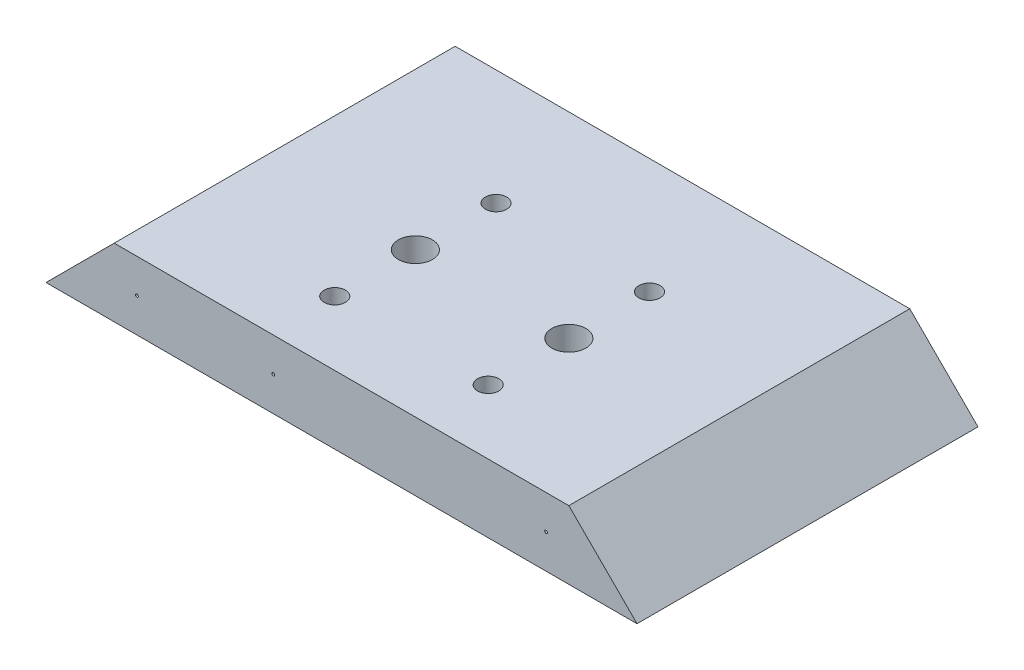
ISO-10303-21;
HEADER;
FILE_DESCRIPTION(('STEP AP214'),'2;1');
FILE_NAME('part.step','',(''),(''),'','','');
FILE_SCHEMA(('AUTOMOTIVE_DESIGN { 1 0 10303 214 1 1 1 1 }'));
ENDSEC;
DATA;
#1=APPLICATION_CONTEXT('core data for automotive mechanical design processes');
#2=APPLICATION_PROTOCOL_DEFINITION('international standard','automotive_design',2000,#1);
#3=PRODUCT_CONTEXT('',#1,'mechanical');
#4=PRODUCT('Part','Part','',(#3));
#5=PRODUCT_RELATED_PRODUCT_CATEGORY('part','',(#4));
#6=PRODUCT_DEFINITION_FORMATION('','',#4);
#7=PRODUCT_DEFINITION_CONTEXT('part definition',#1,'design');
#8=PRODUCT_DEFINITION('design','',#6,#7);
#9=PRODUCT_DEFINITION_SHAPE('','',#8);
#10=(LENGTH_UNIT() NAMED_UNIT(*) SI_UNIT(.MILLI.,.METRE.));
#11=(NAMED_UNIT(*) PLANE_ANGLE_UNIT() SI_UNIT($,.RADIAN.));
#12=(NAMED_UNIT(*) SI_UNIT($,.STERADIAN.) SOLID_ANGLE_UNIT());
#13=UNCERTAINTY_MEASURE_WITH_UNIT(LENGTH_MEASURE(1.E-05),#10,'distance_accuracy_value','');
#14=(GEOMETRIC_REPRESENTATION_CONTEXT(3) GLOBAL_UNCERTAINTY_ASSIGNED_CONTEXT((#13)) GLOBAL_UNIT_ASSIGNED_CONTEXT((#10,
#11,#12)) REPRESENTATION_CONTEXT('',''));
#15=CARTESIAN_POINT('',(0.,0.,0.));
#16=DIRECTION('',(0.,0.,1.));
#17=DIRECTION('',(1.,0.,0.));
#18=AXIS2_PLACEMENT_3D('',#15,#16,#17);
#19=CARTESIAN_POINT('',(0.,38.1,0.));
#20=DIRECTION('',(0.,0.,-1.));
#21=DIRECTION('',(-1.,0.,0.));
#22=AXIS2_PLACEMENT_3D('',#19,#20,#21);
#23=PLANE('',#22);
#24=CARTESIAN_POINT('',(50.8,19.05,0.));
#25=DIRECTION('',(0.,0.,1.));
#26=DIRECTION('',(1.,0.,0.));
#27=AXIS2_PLACEMENT_3D('',#24,#25,#26);
#28=CIRCLE('',#27,0.793749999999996);
#29=CARTESIAN_POINT('',(51.59375,19.05,0.));
#30=VERTEX_POINT('',#29);
#31=EDGE_CURVE('E93',#30,#30,#28,.T.);
#32=ORIENTED_EDGE('',*,*,#31,.F.);
#33=EDGE_LOOP('',(#32));
#34=FACE_BOUND('',#33,.T.);
#35=CARTESIAN_POINT('',(279.4,19.05,0.));
#36=DIRECTION('',(0.,0.,1.));
#37=DIRECTION('',(1.,0.,0.));
#38=AXIS2_PLACEMENT_3D('',#35,#36,#37);
#39=CIRCLE('',#38,0.793749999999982);
#40=CARTESIAN_POINT('',(280.19375,19.05,0.));
#41=VERTEX_POINT('',#40);
#42=EDGE_CURVE('E92',#41,#41,#39,.T.);
#43=ORIENTED_EDGE('',*,*,#42,.F.);
#44=EDGE_LOOP('',(#43));
#45=FACE_BOUND('',#44,.T.);
#46=CARTESIAN_POINT('',(127.,19.05,0.));
#47=DIRECTION('',(0.,0.,1.));
#48=DIRECTION('',(1.,0.,0.));
#49=AXIS2_PLACEMENT_3D('',#46,#47,#48);
#50=CIRCLE('',#49,0.793749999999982);
#51=CARTESIAN_POINT('',(127.79375,19.05,0.));
#52=VERTEX_POINT('',#51);
#53=EDGE_CURVE('E105',#52,#52,#50,.T.);
#54=ORIENTED_EDGE('',*,*,#53,.F.);
#55=EDGE_LOOP('',(#54));
#56=FACE_BOUND('',#55,.T.);
#57=DIRECTION('',(1.,0.,0.));
#58=VECTOR('',#57,1.);
#59=CARTESIAN_POINT('',(0.,38.1,0.));
#60=LINE('',#59,#58);
#61=CARTESIAN_POINT('',(38.0999999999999,38.1,0.));
#62=VERTEX_POINT('',#61);
#63=CARTESIAN_POINT('',(292.1,38.1,0.));
#64=VERTEX_POINT('',#63);
#65=EDGE_CURVE('E112',#62,#64,#60,.T.);
#66=ORIENTED_EDGE('',*,*,#65,.F.);
#67=DIRECTION('',(0.707106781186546,0.707106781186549,0.));
#68=VECTOR('',#67,1.);
#69=CARTESIAN_POINT('',(38.0999999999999,38.1,0.));
#70=LINE('',#69,#68);
#71=CARTESIAN_POINT('',(0.,0.,0.));
#72=VERTEX_POINT('',#71);
#73=EDGE_CURVE('E207',#62,#72,#70,.F.);
#74=ORIENTED_EDGE('',*,*,#73,.T.);
#75=DIRECTION('',(1.,0.,0.));
#76=VECTOR('',#75,1.);
#77=CARTESIAN_POINT('',(0.,0.,0.));
#78=LINE('',#77,#76);
#79=CARTESIAN_POINT('',(330.2,0.,0.));
#80=VERTEX_POINT('',#79);
#81=EDGE_CURVE('E121',#72,#80,#78,.T.);
#82=ORIENTED_EDGE('',*,*,#81,.T.);
#83=DIRECTION('',(0.707106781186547,-0.707106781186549,0.));
#84=VECTOR('',#83,1.);
#85=CARTESIAN_POINT('',(292.1,38.1,0.));
#86=LINE('',#85,#84);
#87=EDGE_CURVE('E210',#80,#64,#86,.F.);
#88=ORIENTED_EDGE('',*,*,#87,.T.);
#89=EDGE_LOOP('',(#66,#74,#82,#88));
#90=FACE_BOUND('',#89,.T.);
#91=ADVANCED_FACE('F35',(#34,#45,#56,#90),#23,.F.);
#92=CARTESIAN_POINT('',(0.,38.1,-190.5));
#93=DIRECTION('',(0.,0.,1.));
#94=DIRECTION('',(1.,0.,0.));
#95=AXIS2_PLACEMENT_3D('',#92,#93,#94);
#96=PLANE('',#95);
#97=DIRECTION('',(-1.,0.,0.));
#98=VECTOR('',#97,1.);
#99=CARTESIAN_POINT('',(0.,0.,-190.5));
#100=LINE('',#99,#98);
#101=CARTESIAN_POINT('',(330.2,0.,-190.5));
#102=VERTEX_POINT('',#101);
#103=CARTESIAN_POINT('',(0.,0.,-190.5));
#104=VERTEX_POINT('',#103);
#105=EDGE_CURVE('E116',#102,#104,#100,.T.);
#106=ORIENTED_EDGE('',*,*,#105,.T.);
#107=DIRECTION('',(-0.707106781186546,-0.707106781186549,0.));
#108=VECTOR('',#107,1.);
#109=CARTESIAN_POINT('',(38.0999999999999,38.1,-190.5));
#110=LINE('',#109,#108);
#111=CARTESIAN_POINT('',(38.0999999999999,38.1,-190.5));
#112=VERTEX_POINT('',#111);
#113=EDGE_CURVE('E11',#104,#112,#110,.F.);
#114=ORIENTED_EDGE('',*,*,#113,.T.);
#115=DIRECTION('',(-1.,0.,0.));
#116=VECTOR('',#115,1.);
#117=CARTESIAN_POINT('',(0.,38.1,-190.5));
#118=LINE('',#117,#116);
#119=CARTESIAN_POINT('',(292.1,38.1,-190.5));
#120=VERTEX_POINT('',#119);
#121=EDGE_CURVE('E115',#120,#112,#118,.T.);
#122=ORIENTED_EDGE('',*,*,#121,.F.);
#123=DIRECTION('',(-0.707106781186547,0.707106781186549,0.));
#124=VECTOR('',#123,1.);
#125=CARTESIAN_POINT('',(292.1,38.1,-190.5));
#126=LINE('',#125,#124);
#127=EDGE_CURVE('E43',#120,#102,#126,.F.);
#128=ORIENTED_EDGE('',*,*,#127,.T.);
#129=EDGE_LOOP('',(#106,#114,#122,#128));
#130=FACE_BOUND('',#129,.T.);
#131=ADVANCED_FACE('F184',(#130),#96,.F.);
#132=CARTESIAN_POINT('',(0.,38.1,0.));
#133=DIRECTION('',(0.,-1.,0.));
#134=DIRECTION('',(0.,0.,-1.));
#135=AXIS2_PLACEMENT_3D('',#132,#133,#134);
#136=PLANE('',#135);
#137=CARTESIAN_POINT('',(125.4125,38.1,-35.9171875));
#138=DIRECTION('',(0.,1.,0.));
#139=DIRECTION('',(0.,0.,1.));
#140=AXIS2_PLACEMENT_3D('',#137,#138,#139);
#141=CIRCLE('',#140,5.95312499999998);
#142=CARTESIAN_POINT('',(125.4125,38.1,-29.9640625));
#143=VERTEX_POINT('',#142);
#144=EDGE_CURVE('E355',#143,#143,#141,.T.);
#145=ORIENTED_EDGE('',*,*,#144,.F.);
#146=EDGE_LOOP('',(#145));
#147=FACE_BOUND('',#146,.T.);
#148=CARTESIAN_POINT('',(125.4125,38.1,-126.0078125));
#149=DIRECTION('',(0.,1.,0.));
#150=DIRECTION('',(0.,0.,1.));
#151=AXIS2_PLACEMENT_3D('',#148,#149,#150);
#152=CIRCLE('',#151,5.95312499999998);
#153=CARTESIAN_POINT('',(125.4125,38.1,-120.0546875));
#154=VERTEX_POINT('',#153);
#155=EDGE_CURVE('E359',#154,#154,#152,.T.);
#156=ORIENTED_EDGE('',*,*,#155,.F.);
#157=EDGE_LOOP('',(#156));
#158=FACE_BOUND('',#157,.T.);
#159=CARTESIAN_POINT('',(211.1375,38.1,-126.0078125));
#160=DIRECTION('',(0.,1.,0.));
#161=DIRECTION('',(0.,0.,1.));
#162=AXIS2_PLACEMENT_3D('',#159,#160,#161);
#163=CIRCLE('',#162,5.95312499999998);
#164=CARTESIAN_POINT('',(211.1375,38.1,-120.0546875));
#165=VERTEX_POINT('',#164);
#166=EDGE_CURVE('E363',#165,#165,#163,.T.);
#167=ORIENTED_EDGE('',*,*,#166,.F.);
#168=EDGE_LOOP('',(#167));
#169=FACE_BOUND('',#168,.T.);
#170=CARTESIAN_POINT('',(211.1375,38.1,-35.9171875));
#171=DIRECTION('',(0.,1.,0.));
#172=DIRECTION('',(0.,0.,1.));
#173=AXIS2_PLACEMENT_3D('',#170,#171,#172);
#174=CIRCLE('',#173,5.95312499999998);
#175=CARTESIAN_POINT('',(211.1375,38.1,-29.9640625));
#176=VERTEX_POINT('',#175);
#177=EDGE_CURVE('E367',#176,#176,#174,.T.);
#178=ORIENTED_EDGE('',*,*,#177,.F.);
#179=EDGE_LOOP('',(#178));
#180=FACE_BOUND('',#179,.T.);
#181=CARTESIAN_POINT('',(211.1375,38.1,-80.9625));
#182=DIRECTION('',(0.,-1.,0.));
#183=DIRECTION('',(0.,0.,-1.));
#184=AXIS2_PLACEMENT_3D('',#181,#182,#183);
#185=CIRCLE('',#184,9.52499999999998);
#186=CARTESIAN_POINT('',(211.1375,38.1,-90.4875));
#187=VERTEX_POINT('',#186);
#188=EDGE_CURVE('E371',#187,#187,#185,.T.);
#189=ORIENTED_EDGE('',*,*,#188,.T.);
#190=EDGE_LOOP('',(#189));
#191=FACE_BOUND('',#190,.T.);
#192=CARTESIAN_POINT('',(125.4125,38.1,-80.9625));
#193=DIRECTION('',(0.,-1.,0.));
#194=DIRECTION('',(0.,0.,-1.));
#195=AXIS2_PLACEMENT_3D('',#192,#193,#194);
#196=CIRCLE('',#195,9.52499999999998);
#197=CARTESIAN_POINT('',(125.4125,38.1,-90.4875));
#198=VERTEX_POINT('',#197);
#199=EDGE_CURVE('E99',#198,#198,#196,.T.);
#200=ORIENTED_EDGE('',*,*,#199,.T.);
#201=EDGE_LOOP('',(#200));
#202=FACE_BOUND('',#201,.T.);
#203=ORIENTED_EDGE('',*,*,#121,.T.);
#204=DIRECTION('',(0.,0.,1.));
#205=VECTOR('',#204,1.);
#206=CARTESIAN_POINT('',(38.0999999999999,38.1,0.));
#207=LINE('',#206,#205);
#208=EDGE_CURVE('E206',#112,#62,#207,.T.);
#209=ORIENTED_EDGE('',*,*,#208,.T.);
#210=ORIENTED_EDGE('',*,*,#65,.T.);
#211=DIRECTION('',(0.,0.,-1.));
#212=VECTOR('',#211,1.);
#213=CARTESIAN_POINT('',(292.1,38.1,0.));
#214=LINE('',#213,#212);
#215=EDGE_CURVE('E118',#64,#120,#214,.T.);
#216=ORIENTED_EDGE('',*,*,#215,.T.);
#217=EDGE_LOOP('',(#203,#209,#210,#216));
#218=FACE_BOUND('',#217,.T.);
#219=ADVANCED_FACE('F190',(#147,#158,#169,#180,#191,#202,#218),#136,.F.);
#220=CARTESIAN_POINT('',(0.,0.,0.));
#221=DIRECTION('',(0.,-1.,0.));
#222=DIRECTION('',(0.,0.,-1.));
#223=AXIS2_PLACEMENT_3D('',#220,#221,#222);
#224=PLANE('',#223);
#225=CARTESIAN_POINT('',(125.4125,0.,-35.9171875));
#226=DIRECTION('',(0.,1.,0.));
#227=DIRECTION('',(0.,0.,1.));
#228=AXIS2_PLACEMENT_3D('',#225,#226,#227);
#229=CIRCLE('',#228,5.95312499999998);
#230=CARTESIAN_POINT('',(125.4125,0.,-29.9640625));
#231=VERTEX_POINT('',#230);
#232=EDGE_CURVE('E134',#231,#231,#229,.T.);
#233=ORIENTED_EDGE('',*,*,#232,.T.);
#234=EDGE_LOOP('',(#233));
#235=FACE_BOUND('',#234,.T.);
#236=CARTESIAN_POINT('',(125.4125,0.,-126.0078125));
#237=DIRECTION('',(0.,1.,0.));
#238=DIRECTION('',(0.,0.,1.));
#239=AXIS2_PLACEMENT_3D('',#236,#237,#238);
#240=CIRCLE('',#239,5.95312499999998);
#241=CARTESIAN_POINT('',(125.4125,0.,-120.0546875));
#242=VERTEX_POINT('',#241);
#243=EDGE_CURVE('E390',#242,#242,#240,.T.);
#244=ORIENTED_EDGE('',*,*,#243,.T.);
#245=EDGE_LOOP('',(#244));
#246=FACE_BOUND('',#245,.T.);
#247=CARTESIAN_POINT('',(211.1375,0.,-126.0078125));
#248=DIRECTION('',(0.,1.,0.));
#249=DIRECTION('',(0.,0.,1.));
#250=AXIS2_PLACEMENT_3D('',#247,#248,#249);
#251=CIRCLE('',#250,5.95312499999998);
#252=CARTESIAN_POINT('',(211.1375,0.,-120.0546875));
#253=VERTEX_POINT('',#252);
#254=EDGE_CURVE('E386',#253,#253,#251,.T.);
#255=ORIENTED_EDGE('',*,*,#254,.T.);
#256=EDGE_LOOP('',(#255));
#257=FACE_BOUND('',#256,.T.);
#258=CARTESIAN_POINT('',(211.1375,0.,-35.9171875));
#259=DIRECTION('',(0.,1.,0.));
#260=DIRECTION('',(0.,0.,1.));
#261=AXIS2_PLACEMENT_3D('',#258,#259,#260);
#262=CIRCLE('',#261,5.95312499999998);
#263=CARTESIAN_POINT('',(211.1375,0.,-29.9640625));
#264=VERTEX_POINT('',#263);
#265=EDGE_CURVE('E382',#264,#264,#262,.T.);
#266=ORIENTED_EDGE('',*,*,#265,.T.);
#267=EDGE_LOOP('',(#266));
#268=FACE_BOUND('',#267,.T.);
#269=CARTESIAN_POINT('',(211.1375,0.,-80.9625));
#270=DIRECTION('',(0.,-1.,0.));
#271=DIRECTION('',(0.,0.,-1.));
#272=AXIS2_PLACEMENT_3D('',#269,#270,#271);
#273=CIRCLE('',#272,9.52500000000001);
#274=CARTESIAN_POINT('',(211.1375,0.,-90.4875));
#275=VERTEX_POINT('',#274);
#276=EDGE_CURVE('E379',#275,#275,#273,.T.);
#277=ORIENTED_EDGE('',*,*,#276,.F.);
#278=EDGE_LOOP('',(#277));
#279=FACE_BOUND('',#278,.T.);
#280=CARTESIAN_POINT('',(125.4125,0.,-80.9625));
#281=DIRECTION('',(0.,-1.,0.));
#282=DIRECTION('',(0.,0.,-1.));
#283=AXIS2_PLACEMENT_3D('',#280,#281,#282);
#284=CIRCLE('',#283,9.52500000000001);
#285=CARTESIAN_POINT('',(125.4125,0.,-90.4875));
#286=VERTEX_POINT('',#285);
#287=EDGE_CURVE('E374',#286,#286,#284,.T.);
#288=ORIENTED_EDGE('',*,*,#287,.F.);
#289=EDGE_LOOP('',(#288));
#290=FACE_BOUND('',#289,.T.);
#291=DIRECTION('',(0.,0.,1.));
#292=VECTOR('',#291,1.);
#293=CARTESIAN_POINT('',(0.,0.,0.));
#294=LINE('',#293,#292);
#295=EDGE_CURVE('E111',#104,#72,#294,.T.);
#296=ORIENTED_EDGE('',*,*,#295,.F.);
#297=ORIENTED_EDGE('',*,*,#105,.F.);
#298=DIRECTION('',(0.,0.,-1.));
#299=VECTOR('',#298,1.);
#300=CARTESIAN_POINT('',(330.2,0.,0.));
#301=LINE('',#300,#299);
#302=EDGE_CURVE('E123',#80,#102,#301,.T.);
#303=ORIENTED_EDGE('',*,*,#302,.F.);
#304=ORIENTED_EDGE('',*,*,#81,.F.);
#305=EDGE_LOOP('',(#296,#297,#303,#304));
#306=FACE_BOUND('',#305,.T.);
#307=ADVANCED_FACE('F179',(#235,#246,#257,#268,#279,#290,#306),#224,.T.);
#308=CARTESIAN_POINT('',(127.,19.05,0.));
#309=DIRECTION('',(0.,0.,1.));
#310=DIRECTION('',(1.,0.,0.));
#311=AXIS2_PLACEMENT_3D('',#308,#309,#310);
#312=CYLINDRICAL_SURFACE('',#311,0.793749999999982);
#313=CARTESIAN_POINT('',(127.79375,19.05,-30.4610583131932));
#314=CARTESIAN_POINT('',(127.793747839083,19.007887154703,-30.4610569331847));
#315=CARTESIAN_POINT('',(127.790382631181,18.9657466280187,-30.4595848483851));
#316=CARTESIAN_POINT('',(127.777059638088,18.8826962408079,-30.4537997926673));
#317=CARTESIAN_POINT('',(127.76709455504,18.8417877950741,-30.4494836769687));
#318=CARTESIAN_POINT('',(127.741016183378,18.7624720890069,-30.438327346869));
#319=CARTESIAN_POINT('',(127.724918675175,18.7240587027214,-30.4314936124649));
#320=CARTESIAN_POINT('',(127.6871626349,18.6505568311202,-30.4157309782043));
#321=CARTESIAN_POINT('',(127.665504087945,18.6154683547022,-30.4068020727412));
#322=CARTESIAN_POINT('',(127.616291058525,18.5479632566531,-30.3869313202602));
#323=CARTESIAN_POINT('',(127.5885287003,18.5157186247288,-30.3759211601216));
#324=CARTESIAN_POINT('',(127.528484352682,18.4562573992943,-30.3527159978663));
#325=CARTESIAN_POINT('',(127.496200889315,18.4290424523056,-30.3405206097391));
#326=CARTESIAN_POINT('',(127.425387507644,18.378347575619,-30.314553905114));
#327=CARTESIAN_POINT('',(127.38657262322,18.3552905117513,-30.3007326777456));
#328=CARTESIAN_POINT('',(127.30564460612,18.3160767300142,-30.2729398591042));
#329=CARTESIAN_POINT('',(127.263530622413,18.2999217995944,-30.2589682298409));
#330=CARTESIAN_POINT('',(127.175470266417,18.2744841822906,-30.2309019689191));
#331=CARTESIAN_POINT('',(127.129440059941,18.2654744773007,-30.2168215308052));
#332=CARTESIAN_POINT('',(127.036242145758,18.2556950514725,-30.1895776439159));
#333=CARTESIAN_POINT('',(126.989074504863,18.25492484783,-30.1764141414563));
#334=CARTESIAN_POINT('',(126.89564689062,18.2617661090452,-30.1515759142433));
#335=CARTESIAN_POINT('',(126.84938336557,18.2692622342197,-30.1398831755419));
#336=CARTESIAN_POINT('',(126.758560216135,18.2924113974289,-30.11804962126));
#337=CARTESIAN_POINT('',(126.714000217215,18.3080626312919,-30.1079084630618));
#338=CARTESIAN_POINT('',(126.629689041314,18.3464562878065,-30.0896716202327));
#339=CARTESIAN_POINT('',(126.58982019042,18.3689107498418,-30.0815134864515));
#340=CARTESIAN_POINT('',(126.514341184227,18.4205056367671,-30.0667923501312));
#341=CARTESIAN_POINT('',(126.478730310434,18.4496449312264,-30.0602290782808));
#342=CARTESIAN_POINT('',(126.413924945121,18.5128377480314,-30.0488062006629));
#343=CARTESIAN_POINT('',(126.384572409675,18.5467213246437,-30.043902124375));
#344=CARTESIAN_POINT('',(126.331924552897,18.6190537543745,-30.0354302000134));
#345=CARTESIAN_POINT('',(126.308628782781,18.65750226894,-30.0318622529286));
#346=CARTESIAN_POINT('',(126.2690772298,18.7373478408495,-30.0259762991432));
#347=CARTESIAN_POINT('',(126.252737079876,18.7787020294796,-30.0236432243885));
#348=CARTESIAN_POINT('',(126.227174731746,18.8635992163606,-30.0200551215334));
#349=CARTESIAN_POINT('',(126.217952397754,18.9071421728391,-30.0188000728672));
#350=CARTESIAN_POINT('',(126.206919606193,18.9950496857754,-30.0173039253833));
#351=CARTESIAN_POINT('',(126.205088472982,19.0394116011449,-30.0170599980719));
#352=CARTESIAN_POINT('',(126.208835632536,19.1278156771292,-30.0175646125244));
#353=CARTESIAN_POINT('',(126.214413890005,19.171857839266,-30.0183131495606));
#354=CARTESIAN_POINT('',(126.232810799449,19.2583619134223,-30.0208434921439));
#355=CARTESIAN_POINT('',(126.245627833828,19.3008241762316,-30.0226250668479));
#356=CARTESIAN_POINT('',(126.278114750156,19.3829739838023,-30.0273083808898));
#357=CARTESIAN_POINT('',(126.297784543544,19.4226615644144,-30.0302101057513));
#358=CARTESIAN_POINT('',(126.343387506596,19.4981568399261,-30.0372490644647));
#359=CARTESIAN_POINT('',(126.369323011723,19.5339630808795,-30.0413867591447));
#360=CARTESIAN_POINT('',(126.426657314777,19.6006831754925,-30.0510111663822));
#361=CARTESIAN_POINT('',(126.458056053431,19.6315970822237,-30.0564978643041));
#362=CARTESIAN_POINT('',(126.525479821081,19.6878113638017,-30.0689270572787));
#363=CARTESIAN_POINT('',(126.561521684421,19.7130903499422,-30.0758749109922));
#364=CARTESIAN_POINT('',(126.637040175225,19.7572574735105,-30.091238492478));
#365=CARTESIAN_POINT('',(126.676516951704,19.7761453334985,-30.0996542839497));
#366=CARTESIAN_POINT('',(126.75832579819,19.8073484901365,-30.1180296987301));
#367=CARTESIAN_POINT('',(126.80069078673,19.8195652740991,-30.1280097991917));
#368=CARTESIAN_POINT('',(126.886538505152,19.8368185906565,-30.1492707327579));
#369=CARTESIAN_POINT('',(126.930021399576,19.8418540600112,-30.1605517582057));
#370=CARTESIAN_POINT('',(127.018259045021,19.8448037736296,-30.1845277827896));
#371=CARTESIAN_POINT('',(127.063012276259,19.8424968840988,-30.1972553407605));
#372=CARTESIAN_POINT('',(127.151284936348,19.8304725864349,-30.2234675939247));
#373=CARTESIAN_POINT('',(127.194804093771,19.8207535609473,-30.236952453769));
#374=CARTESIAN_POINT('',(127.281084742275,19.7937393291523,-30.2647352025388));
#375=CARTESIAN_POINT('',(127.323759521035,19.7761786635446,-30.2790447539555));
#376=CARTESIAN_POINT('',(127.405504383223,19.7339030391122,-30.3074187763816));
#377=CARTESIAN_POINT('',(127.444573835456,19.7091868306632,-30.321483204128));
#378=CARTESIAN_POINT('',(127.518525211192,19.6527944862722,-30.3488904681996));
#379=CARTESIAN_POINT('',(127.553344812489,19.6210304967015,-30.3622212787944));
#380=CARTESIAN_POINT('',(127.617087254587,19.5514642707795,-30.3872085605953));
#381=CARTESIAN_POINT('',(127.646009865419,19.5136617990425,-30.3988649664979));
#382=CARTESIAN_POINT('',(127.695863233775,19.4345930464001,-30.4193107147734));
#383=CARTESIAN_POINT('',(127.717063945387,19.3935218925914,-30.4281949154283));
#384=CARTESIAN_POINT('',(127.752100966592,19.3079020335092,-30.4430363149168));
#385=CARTESIAN_POINT('',(127.765950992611,19.2633599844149,-30.4489989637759));
#386=CARTESIAN_POINT('',(127.781750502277,19.1903531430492,-30.4558334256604));
#387=CARTESIAN_POINT('',(127.786241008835,19.1625131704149,-30.4577862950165));
#388=CARTESIAN_POINT('',(127.79224139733,19.1064529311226,-30.4603991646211));
#389=CARTESIAN_POINT('',(127.793751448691,19.0782326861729,-30.4610592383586));
#390=CARTESIAN_POINT('',(127.79375,19.05,-30.4610583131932));
#391=B_SPLINE_CURVE_WITH_KNOTS('',3,(#313,#314,#315,#316,#317,#318,#319,#320,#321,#322,#323,
#324,#325,#326,#327,#328,#329,#330,#331,#332,#333,#334,#335,#336,#337,#338,#339,#340,#341,#342,
#343,#344,#345,#346,#347,#348,#349,#350,#351,#352,#353,#354,#355,#356,#357,#358,#359,#360,#361,
#362,#363,#364,#365,#366,#367,#368,#369,#370,#371,#372,#373,#374,#375,#376,#377,#378,#379,#380,
#381,#382,#383,#384,#385,#386,#387,#388,#389,#390),.UNSPECIFIED.,.T.,.F.,(4,2,2,2,2,2,2,2,2,2,2,
2,2,2,2,2,2,2,2,2,2,2,2,2,2,2,2,2,2,2,2,2,2,2,2,2,2,2,4),(0.,0.126230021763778,
0.252599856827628,0.378646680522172,0.504693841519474,0.635987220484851,0.767323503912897,
0.908335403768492,1.0493837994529,1.19559136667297,1.34179036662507,1.48597497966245,
1.63012770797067,1.7688741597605,1.90759716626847,2.04223584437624,2.17686454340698,
2.30981023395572,2.44275338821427,2.57532439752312,2.70789477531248,2.8404355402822,
2.972974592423,3.10556312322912,3.23815021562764,3.37123231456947,3.50432018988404,
3.63932361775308,3.77434703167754,3.91347506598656,4.05263346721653,4.19690920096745,
4.34121014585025,4.48742247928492,4.63364051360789,4.77409823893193,4.91429293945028,
4.99892306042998,5.08354837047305),.UNSPECIFIED.);
#392=CARTESIAN_POINT('',(127.79375,19.05,-30.4610583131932));
#393=VERTEX_POINT('',#392);
#394=EDGE_CURVE('E126',#393,#393,#391,.T.);
#395=ORIENTED_EDGE('',*,*,#394,.T.);
#396=EDGE_LOOP('',(#395));
#397=FACE_BOUND('',#396,.T.);
#398=ORIENTED_EDGE('',*,*,#53,.T.);
#399=EDGE_LOOP('',(#398));
#400=FACE_BOUND('',#399,.T.);
#401=ADVANCED_FACE('F138',(#397,#400),#312,.F.);
#402=CARTESIAN_POINT('',(279.4,19.05,-50.8));
#403=DIRECTION('',(0.,0.,1.));
#404=DIRECTION('',(1.,0.,0.));
#405=AXIS2_PLACEMENT_3D('',#402,#403,#404);
#406=CONICAL_SURFACE('',#405,0.793749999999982,1.02974425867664);
#407=CARTESIAN_POINT('',(279.4,19.05,-51.2769331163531));
#408=VERTEX_POINT('',#407);
#409=VERTEX_LOOP('',#408);
#410=FACE_BOUND('',#409,.T.);
#411=CARTESIAN_POINT('',(279.4,19.05,-50.8));
#412=DIRECTION('',(0.,0.,1.));
#413=DIRECTION('',(1.,0.,0.));
#414=AXIS2_PLACEMENT_3D('',#411,#412,#413);
#415=CIRCLE('',#414,0.793749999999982);
#416=CARTESIAN_POINT('',(280.19375,19.05,-50.8));
#417=VERTEX_POINT('',#416);
#418=EDGE_CURVE('E96',#417,#417,#415,.T.);
#419=ORIENTED_EDGE('',*,*,#418,.T.);
#420=EDGE_LOOP('',(#419));
#421=FACE_BOUND('',#420,.T.);
#422=ADVANCED_FACE('F172',(#410,#421),#406,.F.);
#423=CARTESIAN_POINT('',(279.4,19.05,0.));
#424=DIRECTION('',(0.,0.,1.));
#425=DIRECTION('',(1.,0.,0.));
#426=AXIS2_PLACEMENT_3D('',#423,#424,#425);
#427=CYLINDRICAL_SURFACE('',#426,0.793749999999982);
#428=ORIENTED_EDGE('',*,*,#418,.F.);
#429=EDGE_LOOP('',(#428));
#430=FACE_BOUND('',#429,.T.);
#431=ORIENTED_EDGE('',*,*,#42,.T.);
#432=EDGE_LOOP('',(#431));
#433=FACE_BOUND('',#432,.T.);
#434=ADVANCED_FACE('F86',(#430,#433),#427,.F.);
#435=CARTESIAN_POINT('',(50.8,19.05,-50.8));
#436=DIRECTION('',(0.,0.,1.));
#437=DIRECTION('',(1.,0.,0.));
#438=AXIS2_PLACEMENT_3D('',#435,#436,#437);
#439=CONICAL_SURFACE('',#438,0.793749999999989,1.02974425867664);
#440=CARTESIAN_POINT('',(50.8,19.05,-51.2769331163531));
#441=VERTEX_POINT('',#440);
#442=VERTEX_LOOP('',#441);
#443=FACE_BOUND('',#442,.T.);
#444=CARTESIAN_POINT('',(50.8,19.05,-50.8));
#445=DIRECTION('',(0.,0.,1.));
#446=DIRECTION('',(1.,0.,0.));
#447=AXIS2_PLACEMENT_3D('',#444,#445,#446);
#448=CIRCLE('',#447,0.793749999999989);
#449=CARTESIAN_POINT('',(51.59375,19.05,-50.8));
#450=VERTEX_POINT('',#449);
#451=EDGE_CURVE('E90',#450,#450,#448,.T.);
#452=ORIENTED_EDGE('',*,*,#451,.T.);
#453=EDGE_LOOP('',(#452));
#454=FACE_BOUND('',#453,.T.);
#455=ADVANCED_FACE('F82',(#443,#454),#439,.F.);
#456=CARTESIAN_POINT('',(50.8,19.05,0.));
#457=DIRECTION('',(0.,0.,1.));
#458=DIRECTION('',(1.,0.,0.));
#459=AXIS2_PLACEMENT_3D('',#456,#457,#458);
#460=CYLINDRICAL_SURFACE('',#459,0.793749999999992);
#461=ORIENTED_EDGE('',*,*,#451,.F.);
#462=EDGE_LOOP('',(#461));
#463=FACE_BOUND('',#462,.T.);
#464=ORIENTED_EDGE('',*,*,#31,.T.);
#465=EDGE_LOOP('',(#464));
#466=FACE_BOUND('',#465,.T.);
#467=ADVANCED_FACE('F85',(#463,#466),#460,.F.);
#468=CARTESIAN_POINT('',(125.4125,0.,-80.9625));
#469=DIRECTION('',(0.,-1.,0.));
#470=DIRECTION('',(0.,0.,-1.));
#471=AXIS2_PLACEMENT_3D('',#468,#469,#470);
#472=CYLINDRICAL_SURFACE('',#471,9.52499999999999);
#473=ORIENTED_EDGE('',*,*,#199,.F.);
#474=EDGE_LOOP('',(#473));
#475=FACE_BOUND('',#474,.T.);
#476=ORIENTED_EDGE('',*,*,#287,.T.);
#477=EDGE_LOOP('',(#476));
#478=FACE_BOUND('',#477,.T.);
#479=ADVANCED_FACE('F164',(#475,#478),#472,.F.);
#480=CARTESIAN_POINT('',(211.1375,0.,-80.9625));
#481=DIRECTION('',(0.,-1.,0.));
#482=DIRECTION('',(0.,0.,-1.));
#483=AXIS2_PLACEMENT_3D('',#480,#481,#482);
#484=CYLINDRICAL_SURFACE('',#483,9.52499999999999);
#485=ORIENTED_EDGE('',*,*,#188,.F.);
#486=EDGE_LOOP('',(#485));
#487=FACE_BOUND('',#486,.T.);
#488=ORIENTED_EDGE('',*,*,#276,.T.);
#489=EDGE_LOOP('',(#488));
#490=FACE_BOUND('',#489,.T.);
#491=ADVANCED_FACE('F160',(#487,#490),#484,.F.);
#492=CARTESIAN_POINT('',(211.1375,38.1,-35.9171875));
#493=DIRECTION('',(0.,1.,0.));
#494=DIRECTION('',(0.,0.,1.));
#495=AXIS2_PLACEMENT_3D('',#492,#493,#494);
#496=CYLINDRICAL_SURFACE('',#495,5.95312499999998);
#497=ORIENTED_EDGE('',*,*,#265,.F.);
#498=EDGE_LOOP('',(#497));
#499=FACE_BOUND('',#498,.T.);
#500=ORIENTED_EDGE('',*,*,#177,.T.);
#501=EDGE_LOOP('',(#500));
#502=FACE_BOUND('',#501,.T.);
#503=ADVANCED_FACE('F156',(#499,#502),#496,.F.);
#504=CARTESIAN_POINT('',(211.1375,38.1,-126.0078125));
#505=DIRECTION('',(0.,1.,0.));
#506=DIRECTION('',(0.,0.,1.));
#507=AXIS2_PLACEMENT_3D('',#504,#505,#506);
#508=CYLINDRICAL_SURFACE('',#507,5.95312499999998);
#509=ORIENTED_EDGE('',*,*,#254,.F.);
#510=EDGE_LOOP('',(#509));
#511=FACE_BOUND('',#510,.T.);
#512=ORIENTED_EDGE('',*,*,#166,.T.);
#513=EDGE_LOOP('',(#512));
#514=FACE_BOUND('',#513,.T.);
#515=ADVANCED_FACE('F152',(#511,#514),#508,.F.);
#516=CARTESIAN_POINT('',(125.4125,38.1,-126.0078125));
#517=DIRECTION('',(0.,1.,0.));
#518=DIRECTION('',(0.,0.,1.));
#519=AXIS2_PLACEMENT_3D('',#516,#517,#518);
#520=CYLINDRICAL_SURFACE('',#519,5.95312499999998);
#521=ORIENTED_EDGE('',*,*,#243,.F.);
#522=EDGE_LOOP('',(#521));
#523=FACE_BOUND('',#522,.T.);
#524=ORIENTED_EDGE('',*,*,#155,.T.);
#525=EDGE_LOOP('',(#524));
#526=FACE_BOUND('',#525,.T.);
#527=ADVANCED_FACE('F147',(#523,#526),#520,.F.);
#528=CARTESIAN_POINT('',(125.4125,38.1,-35.9171875));
#529=DIRECTION('',(0.,1.,0.));
#530=DIRECTION('',(0.,0.,1.));
#531=AXIS2_PLACEMENT_3D('',#528,#529,#530);
#532=CYLINDRICAL_SURFACE('',#531,5.95312499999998);
#533=ORIENTED_EDGE('',*,*,#394,.F.);
#534=EDGE_LOOP('',(#533));
#535=FACE_BOUND('',#534,.T.);
#536=ORIENTED_EDGE('',*,*,#232,.F.);
#537=EDGE_LOOP('',(#536));
#538=FACE_BOUND('',#537,.T.);
#539=ORIENTED_EDGE('',*,*,#144,.T.);
#540=EDGE_LOOP('',(#539));
#541=FACE_BOUND('',#540,.T.);
#542=CARTESIAN_POINT('',(127.79375,19.05,-41.3733166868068));
#543=CARTESIAN_POINT('',(127.793747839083,19.092112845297,-41.3733180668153));
#544=CARTESIAN_POINT('',(127.790382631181,19.1342533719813,-41.3747901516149));
#545=CARTESIAN_POINT('',(127.777059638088,19.2173037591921,-41.3805752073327));
#546=CARTESIAN_POINT('',(127.76709455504,19.2582122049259,-41.3848913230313));
#547=CARTESIAN_POINT('',(127.741016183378,19.3375279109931,-41.396047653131));
#548=CARTESIAN_POINT('',(127.724918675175,19.3759412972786,-41.4028813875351));
#549=CARTESIAN_POINT('',(127.6871626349,19.4494431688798,-41.4186440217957));
#550=CARTESIAN_POINT('',(127.665504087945,19.4845316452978,-41.4275729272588));
#551=CARTESIAN_POINT('',(127.616291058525,19.5520367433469,-41.4474436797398));
#552=CARTESIAN_POINT('',(127.5885287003,19.5842813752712,-41.4584538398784));
#553=CARTESIAN_POINT('',(127.528484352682,19.6437426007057,-41.4816590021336));
#554=CARTESIAN_POINT('',(127.496200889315,19.6709575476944,-41.4938543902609));
#555=CARTESIAN_POINT('',(127.425387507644,19.721652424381,-41.519821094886));
#556=CARTESIAN_POINT('',(127.38657262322,19.7447094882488,-41.5336423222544));
#557=CARTESIAN_POINT('',(127.30564460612,19.7839232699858,-41.5614351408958));
#558=CARTESIAN_POINT('',(127.263530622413,19.8000782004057,-41.5754067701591));
#559=CARTESIAN_POINT('',(127.175470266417,19.8255158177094,-41.6034730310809));
#560=CARTESIAN_POINT('',(127.129440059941,19.8345255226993,-41.6175534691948));
#561=CARTESIAN_POINT('',(127.036242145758,19.8443049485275,-41.6447973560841));
#562=CARTESIAN_POINT('',(126.989074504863,19.84507515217,-41.6579608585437));
#563=CARTESIAN_POINT('',(126.89564689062,19.8382338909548,-41.6827990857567));
#564=CARTESIAN_POINT('',(126.84938336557,19.8307377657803,-41.6944918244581));
#565=CARTESIAN_POINT('',(126.758560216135,19.8075886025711,-41.71632537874));
#566=CARTESIAN_POINT('',(126.714000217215,19.7919373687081,-41.7264665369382));
#567=CARTESIAN_POINT('',(126.629689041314,19.7535437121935,-41.7447033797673));
#568=CARTESIAN_POINT('',(126.58982019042,19.7310892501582,-41.7528615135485));
#569=CARTESIAN_POINT('',(126.514341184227,19.6794943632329,-41.7675826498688));
#570=CARTESIAN_POINT('',(126.478730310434,19.6503550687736,-41.7741459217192));
#571=CARTESIAN_POINT('',(126.413924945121,19.5871622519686,-41.7855687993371));
#572=CARTESIAN_POINT('',(126.384572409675,19.5532786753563,-41.7904728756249));
#573=CARTESIAN_POINT('',(126.331924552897,19.4809462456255,-41.7989447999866));
#574=CARTESIAN_POINT('',(126.308628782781,19.44249773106,-41.8025127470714));
#575=CARTESIAN_POINT('',(126.2690772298,19.3626521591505,-41.8083987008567));
#576=CARTESIAN_POINT('',(126.252737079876,19.3212979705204,-41.8107317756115));
#577=CARTESIAN_POINT('',(126.227174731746,19.2364007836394,-41.8143198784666));
#578=CARTESIAN_POINT('',(126.217952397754,19.1928578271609,-41.8155749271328));
#579=CARTESIAN_POINT('',(126.206919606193,19.1049503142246,-41.8170710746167));
#580=CARTESIAN_POINT('',(126.205088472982,19.0605883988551,-41.8173150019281));
#581=CARTESIAN_POINT('',(126.208835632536,18.9721843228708,-41.8168103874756));
#582=CARTESIAN_POINT('',(126.214413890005,18.928142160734,-41.8160618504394));
#583=CARTESIAN_POINT('',(126.232810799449,18.8416380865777,-41.8135315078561));
#584=CARTESIAN_POINT('',(126.245627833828,18.7991758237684,-41.8117499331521));
#585=CARTESIAN_POINT('',(126.278114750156,18.7170260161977,-41.8070666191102));
#586=CARTESIAN_POINT('',(126.297784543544,18.6773384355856,-41.8041648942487));
#587=CARTESIAN_POINT('',(126.343387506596,18.6018431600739,-41.7971259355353));
#588=CARTESIAN_POINT('',(126.369323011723,18.5660369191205,-41.7929882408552));
#589=CARTESIAN_POINT('',(126.426657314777,18.4993168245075,-41.7833638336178));
#590=CARTESIAN_POINT('',(126.458056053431,18.4684029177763,-41.7778771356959));
#591=CARTESIAN_POINT('',(126.525479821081,18.4121886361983,-41.7654479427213));
#592=CARTESIAN_POINT('',(126.561521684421,18.3869096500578,-41.7585000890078));
#593=CARTESIAN_POINT('',(126.637040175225,18.3427425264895,-41.743136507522));
#594=CARTESIAN_POINT('',(126.676516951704,18.3238546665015,-41.7347207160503));
#595=CARTESIAN_POINT('',(126.75832579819,18.2926515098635,-41.7163453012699));
#596=CARTESIAN_POINT('',(126.80069078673,18.2804347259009,-41.7063652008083));
#597=CARTESIAN_POINT('',(126.886538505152,18.2631814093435,-41.6851042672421));
#598=CARTESIAN_POINT('',(126.930021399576,18.2581459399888,-41.6738232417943));
#599=CARTESIAN_POINT('',(127.018259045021,18.2551962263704,-41.6498472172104));
#600=CARTESIAN_POINT('',(127.063012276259,18.2575031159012,-41.6371196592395));
#601=CARTESIAN_POINT('',(127.151284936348,18.2695274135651,-41.6109074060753));
#602=CARTESIAN_POINT('',(127.194804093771,18.2792464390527,-41.597422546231));
#603=CARTESIAN_POINT('',(127.281084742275,18.3062606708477,-41.5696397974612));
#604=CARTESIAN_POINT('',(127.323759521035,18.3238213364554,-41.5553302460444));
#605=CARTESIAN_POINT('',(127.405504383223,18.3660969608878,-41.5269562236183));
#606=CARTESIAN_POINT('',(127.444573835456,18.3908131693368,-41.512891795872));
#607=CARTESIAN_POINT('',(127.518525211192,18.4472055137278,-41.4854845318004));
#608=CARTESIAN_POINT('',(127.553344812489,18.4789695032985,-41.4721537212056));
#609=CARTESIAN_POINT('',(127.617087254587,18.5485357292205,-41.4471664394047));
#610=CARTESIAN_POINT('',(127.646009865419,18.5863382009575,-41.4355100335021));
#611=CARTESIAN_POINT('',(127.695863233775,18.6654069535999,-41.4150642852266));
#612=CARTESIAN_POINT('',(127.717063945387,18.7064781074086,-41.4061800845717));
#613=CARTESIAN_POINT('',(127.752100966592,18.7920979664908,-41.3913386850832));
#614=CARTESIAN_POINT('',(127.765950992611,18.8366400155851,-41.3853760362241));
#615=CARTESIAN_POINT('',(127.781750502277,18.9096468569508,-41.3785415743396));
#616=CARTESIAN_POINT('',(127.786241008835,18.9374868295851,-41.3765887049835));
#617=CARTESIAN_POINT('',(127.79224139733,18.9935470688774,-41.3739758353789));
#618=CARTESIAN_POINT('',(127.793751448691,19.0217673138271,-41.3733157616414));
#619=CARTESIAN_POINT('',(127.79375,19.05,-41.3733166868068));
#620=B_SPLINE_CURVE_WITH_KNOTS('',3,(#542,#543,#544,#545,#546,#547,#548,#549,#550,#551,#552,
#553,#554,#555,#556,#557,#558,#559,#560,#561,#562,#563,#564,#565,#566,#567,#568,#569,#570,#571,
#572,#573,#574,#575,#576,#577,#578,#579,#580,#581,#582,#583,#584,#585,#586,#587,#588,#589,#590,
#591,#592,#593,#594,#595,#596,#597,#598,#599,#600,#601,#602,#603,#604,#605,#606,#607,#608,#609,
#610,#611,#612,#613,#614,#615,#616,#617,#618,#619),.UNSPECIFIED.,.T.,.F.,(4,2,2,2,2,2,2,2,2,2,2,
2,2,2,2,2,2,2,2,2,2,2,2,2,2,2,2,2,2,2,2,2,2,2,2,2,2,2,4),(0.,0.126230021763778,
0.252599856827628,0.378646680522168,0.504693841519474,0.635987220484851,0.767323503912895,
0.908335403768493,1.0493837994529,1.19559136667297,1.34179036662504,1.48597497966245,
1.63012770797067,1.7688741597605,1.90759716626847,2.04223584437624,2.17686454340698,
2.30981023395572,2.44275338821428,2.57532439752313,2.70789477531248,2.84043554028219,
2.972974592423,3.10556312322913,3.23815021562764,3.37123231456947,3.50432018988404,
3.63932361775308,3.77434703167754,3.91347506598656,4.05263346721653,4.19690920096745,
4.34121014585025,4.48742247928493,4.6336405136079,4.77409823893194,4.91429293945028,
4.99892306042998,5.08354837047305),.UNSPECIFIED.);
#621=CARTESIAN_POINT('',(127.79375,19.05,-41.3733166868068));
#622=VERTEX_POINT('',#621);
#623=EDGE_CURVE('E133',#622,#622,#620,.T.);
#624=ORIENTED_EDGE('',*,*,#623,.F.);
#625=EDGE_LOOP('',(#624));
#626=FACE_BOUND('',#625,.T.);
#627=ADVANCED_FACE('F142',(#535,#538,#541,#626),#532,.F.);
#628=CARTESIAN_POINT('',(127.,19.05,-50.8));
#629=DIRECTION('',(0.,0.,1.));
#630=DIRECTION('',(1.,0.,0.));
#631=AXIS2_PLACEMENT_3D('',#628,#629,#630);
#632=CONICAL_SURFACE('',#631,0.793749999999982,1.02974425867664);
#633=CARTESIAN_POINT('',(127.,19.05,-51.2769331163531));
#634=VERTEX_POINT('',#633);
#635=VERTEX_LOOP('',#634);
#636=FACE_BOUND('',#635,.T.);
#637=CARTESIAN_POINT('',(127.,19.05,-50.8));
#638=DIRECTION('',(0.,0.,1.));
#639=DIRECTION('',(1.,0.,0.));
#640=AXIS2_PLACEMENT_3D('',#637,#638,#639);
#641=CIRCLE('',#640,0.793749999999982);
#642=CARTESIAN_POINT('',(127.79375,19.05,-50.8));
#643=VERTEX_POINT('',#642);
#644=EDGE_CURVE('E108',#643,#643,#641,.T.);
#645=ORIENTED_EDGE('',*,*,#644,.T.);
#646=EDGE_LOOP('',(#645));
#647=FACE_BOUND('',#646,.T.);
#648=ADVANCED_FACE('F146',(#636,#647),#632,.F.);
#649=ORIENTED_EDGE('',*,*,#623,.T.);
#650=EDGE_LOOP('',(#649));
#651=FACE_BOUND('',#650,.T.);
#652=ORIENTED_EDGE('',*,*,#644,.F.);
#653=EDGE_LOOP('',(#652));
#654=FACE_BOUND('',#653,.T.);
#655=ADVANCED_FACE('F181',(#651,#654),#312,.F.);
#656=CARTESIAN_POINT('',(38.0999999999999,38.1,0.));
#657=DIRECTION('',(0.707106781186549,-0.707106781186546,0.));
#658=DIRECTION('',(0.,0.,1.));
#659=AXIS2_PLACEMENT_3D('',#656,#657,#658);
#660=PLANE('',#659);
#661=ORIENTED_EDGE('',*,*,#113,.F.);
#662=ORIENTED_EDGE('',*,*,#295,.T.);
#663=ORIENTED_EDGE('',*,*,#73,.F.);
#664=ORIENTED_EDGE('',*,*,#208,.F.);
#665=EDGE_LOOP('',(#661,#662,#663,#664));
#666=FACE_BOUND('',#665,.T.);
#667=ADVANCED_FACE('F195',(#666),#660,.F.);
#668=CARTESIAN_POINT('',(292.1,38.1,0.));
#669=DIRECTION('',(-0.707106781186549,-0.707106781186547,0.));
#670=DIRECTION('',(0.,0.,-1.));
#671=AXIS2_PLACEMENT_3D('',#668,#669,#670);
#672=PLANE('',#671);
#673=ORIENTED_EDGE('',*,*,#87,.F.);
#674=ORIENTED_EDGE('',*,*,#302,.T.);
#675=ORIENTED_EDGE('',*,*,#127,.F.);
#676=ORIENTED_EDGE('',*,*,#215,.F.);
#677=EDGE_LOOP('',(#673,#674,#675,#676));
#678=FACE_BOUND('',#677,.T.);
#679=ADVANCED_FACE('F37',(#678),#672,.F.);
#680=CLOSED_SHELL('',(#91,#131,#219,#307,#401,#422,#434,#455,#467,#479,#491,#503,#515,#527,#627,
#648,#655,#667,#679));
#681=MANIFOLD_SOLID_BREP('B2',#680);
#682=ADVANCED_BREP_SHAPE_REPRESENTATION('',(#18,#681),#14);
#683=SHAPE_DEFINITION_REPRESENTATION(#9,#682);
ENDSEC;
END-ISO-10303-21;
